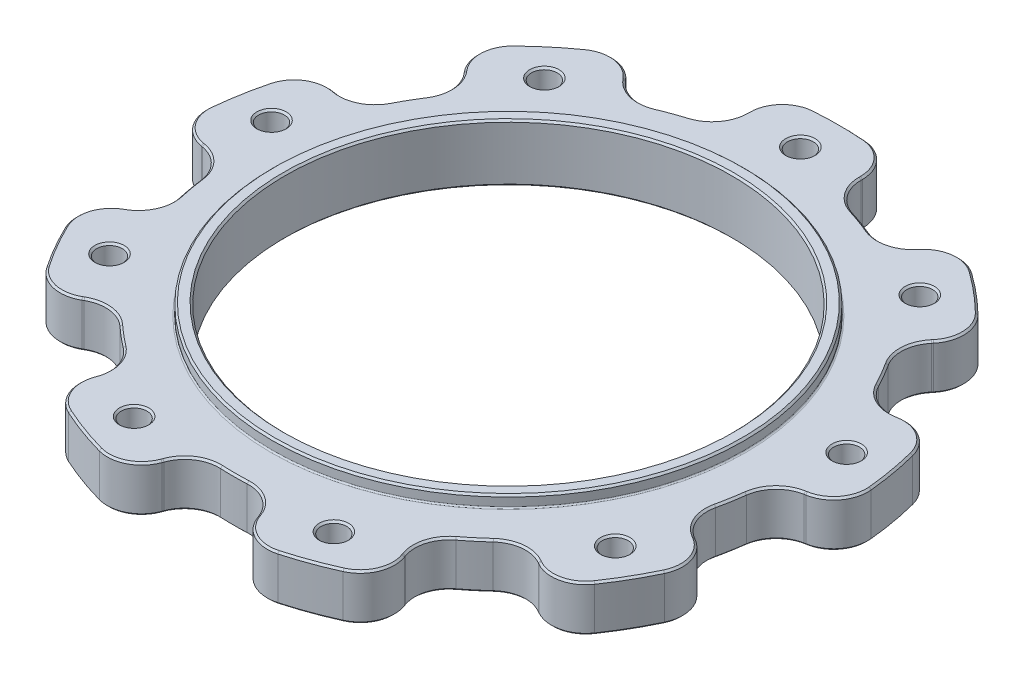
from build123d import *

# Parameters (mm, degrees)
SKETCH2_R               = 76.2
SKETCH2_R_2             = 65.405
SKETCH2_R_3             = 61.9125
BOSS_EXTRUDE2_DEPTH     = 6.35
BOSS_EXTRUDE4_START     = -6.35
SKETCH2_5_R             = 65.405
SKETCH2_5_R_2           = 61.9125
BOSS_EXTRUDE4_DEPTH     = 15.875
BOSS_EXTRUDE3_DEPTH     = 6.35
F_1_4_CLEARANCE_HOLE1_D = 7.1374
CIRPATTERN1_COUNT       = 9
FILLET1_R               = 9.525
FILLET2_R               = 0.381
CHAMFER1_SIZE           = 0.508


with BuildPart() as part:
    # Sketch2 → Boss-Extrude2 (new, symmetric)
    # profile 1 of 2: a face of its own
    with BuildSketch(Plane(origin=(0, 0, 0), x_dir=(1, 0, 0), z_dir=(0, 1, 0))):
        with Locations(Location((0, 0, 0), (0, 0, 270))):
            Circle(SKETCH2_R)
        Circle(SKETCH2_R_2, mode=Mode.SUBTRACT)
    # profile 2 of 2: a face of its own
    with BuildSketch(Plane(origin=(0, 0, 0), x_dir=(1, 0, 0), z_dir=(0, 1, 0))):
        Circle(SKETCH2_R_2)
        with Locations(Location((0, 0, 0), (0, 0, 270))):
            Circle(SKETCH2_R_3, mode=Mode.SUBTRACT)
    extrude(amount=BOSS_EXTRUDE2_DEPTH, both=True)

    # Sketch2_5 → Boss-Extrude4 (add)
    with BuildSketch(Plane(origin=(0, 0, 0), x_dir=(1, 0, 0), z_dir=(0, 1, 0)).offset(BOSS_EXTRUDE4_START)):
        with Locations(Location((0, 0, 0), (0, 0, 270))):
            Circle(SKETCH2_5_R)
        with Locations(Location((0, 0, 0), (0, 0, 270))):
            Circle(SKETCH2_5_R_2, mode=Mode.SUBTRACT)
    extrude(amount=BOSS_EXTRUDE4_DEPTH)

    # Sketch2_3 → Boss-Extrude3 (add, symmetric)
    with BuildSketch(Plane(origin=(0, 0, 0), x_dir=(1, 0, 0), z_dir=(0, 1, 0))):
        with BuildLine():
            Line((-15.875, 90.696141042), (-15.875, 74.528010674))
            ThreePointArc((-15.875, 74.528010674), (0, 76.2), (15.875, 74.528010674))
            Line((15.875, 74.528010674), (15.875, 90.696141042))
            ThreePointArc((15.875, 90.696141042), (0, 92.075), (-15.875, 90.696141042))
        make_face()
    boss_extrude3 = extrude(amount=BOSS_EXTRUDE3_DEPTH, both=True)

    # 1_4 Clearance Hole1 (through all)
    with Locations(Plane(origin=(0, 6.35, 0), x_dir=(1, 0, 0), z_dir=(0, 1, 0))):
        with Locations((0, 80.9625)):
            f_1_4_clearance_hole1 = Hole(F_1_4_CLEARANCE_HOLE1_D / 2)

    # CirPattern1: Boss-Extrude3, 1_4 Clearance Hole1 ×9 about axis
    cirpattern1_axis = Axis((0, 0, 0), (0, 1, 0))
    add([boss_extrude3.rotate(cirpattern1_axis, i * 360 / CIRPATTERN1_COUNT) for i in range(1, CIRPATTERN1_COUNT)])
    add([f_1_4_clearance_hole1.rotate(cirpattern1_axis, i * 360 / CIRPATTERN1_COUNT) for i in range(1, CIRPATTERN1_COUNT)], mode=Mode.SUBTRACT)

    # Fillet1
    fillet1_edges = [part.edges().sort_by_distance(p)[0] for p in [
        (60.06663737, 0, -46.88751513),
        (15.875, 0, -90.696141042),
        (-15.875, 0, -90.696141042),
        (-15.875, 0, -74.528010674),
        (15.875, 0, -74.528010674),
        (92.074927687, 0, -0.115396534),
        (86.561598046, 0, -31.383042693),
        (70.639097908, 0, -28.575476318),
        (76.152427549, 0, 2.69216984),
        (70.607662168, 0, 59.096223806),
        (86.482662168, 0, 31.599917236),
        (72.480650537, 0, 23.515852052),
        (56.605650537, 0, 51.012158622),
        (16.102286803, 0, 90.656064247),
        (45.937527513, 0, 79.796924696),
        (40.407701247, 0, 64.603851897),
        (10.572460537, 0, 75.462991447),
        (-45.937527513, 0, 79.796924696),
        (-16.102286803, 0, 90.656064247),
        (-10.572460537, 0, 75.462991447),
        (-40.407701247, 0, 64.603851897),
        (-86.482662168, 0, 31.599917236),
        (-70.607662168, 0, 59.096223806),
        (-56.605650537, 0, 51.012158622),
        (-72.480650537, 0, 23.515852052),
        (-86.561598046, 0, -31.383042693),
        (-92.074927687, 0, -0.115396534),
        (-76.152427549, 0, 2.69216984),
        (-70.639097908, 0, -28.575476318),
        (-46.137400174, 0, -79.681528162),
        (-70.459311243, 0, -59.273021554),
        (-60.06663737, 0, -46.88751513),
        (-35.744726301, 0, -67.296021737),
        (70.459311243, 0, -59.273021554),
        (46.137400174, 0, -79.681528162),
        (35.744726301, 0, -67.296021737),
    ]]
    fillet(fillet1_edges, radius=FILLET1_R)

    # Fillet2
    fillet2_edges = [part.edges().sort_by_distance(p)[0] for p in [
        (0, 6.35, -65.405),
    ]]
    fillet(fillet2_edges, radius=FILLET2_R)

    # Chamfer1
    chamfer1_edges = [part.edges().sort_by_distance(p)[0] for p in [
        (0, 9.525, -65.405),
        (0, 9.525, -61.9125),
        (54.775474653, 6.35, -59.726957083),
        (54.775474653, -6.35, -59.726957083),
        (80.352195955, 6.35, -10.544507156),
        (80.352195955, -6.35, -10.544507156),
        (68.331231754, 6.35, 43.571834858),
        (68.331231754, -6.35, 43.571834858),
        (24.337324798, 6.35, 77.300431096),
        (24.337324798, -6.35, 77.300431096),
        (-31.04428691, 6.35, 74.859296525),
        (-31.04428691, -6.35, 74.859296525),
        (-71.899931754, 6.35, 37.390665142),
        (-71.899931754, -6.35, 37.390665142),
        (-79.112799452, 6.35, -17.573474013),
        (-79.112799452, -6.35, -17.573474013),
        (-49.307909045, 6.35, -64.314789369),
        (-49.307909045, -6.35, -64.314789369),
        (79.029966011, -6.35, 27.297101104),
        (79.029966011, 6.35, 27.297101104),
        (-26.061934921, -6.35, -71.604577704),
        (-15.875, -6.35, -82.090508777),
        (0, -6.35, -92.075),
        (15.875, -6.35, -82.090508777),
        (26.061934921, -6.35, -71.604577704),
        (40.60580638, -6.35, -73.089231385),
        (59.184669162, -6.35, -70.5335421),
        (64.927717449, -6.35, -52.680724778),
        (65.991135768, -6.35, -38.1),
        (78.086704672, -6.35, -29.888690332),
        (90.676173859, -6.35, -15.988655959),
        (83.600034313, -6.35, 1.378955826),
        (75.04235078, -6.35, 13.231991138),
        (79.739289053, -6.35, 46.0375),
        (63.154966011, -6.35, 54.793407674),
        (48.980415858, -6.35, 58.372586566),
        (42.994227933, -6.35, 71.710275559),
        (31.491504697, -6.35, 86.522198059),
        (13.158987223, -6.35, 82.56941511),
        (0, -6.35, 76.2),
        (-13.158987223, -6.35, 82.56941511),
        (-31.491504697, -6.35, 86.522198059),
        (-42.994227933, -6.35, 71.710275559),
        (-48.980415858, -6.35, 58.372586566),
        (-63.154966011, -6.35, 54.793407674),
        (-79.739289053, -6.35, 46.0375),
        (-79.029966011, -6.35, 27.297101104),
        (-75.04235078, -6.35, 13.231991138),
        (-83.600034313, -6.35, 1.378955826),
        (-90.676173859, -6.35, -15.988655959),
        (-78.086704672, -6.35, -29.888690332),
        (-65.991135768, -6.35, -38.1),
        (-64.927717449, -6.35, -52.680724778),
        (-59.184669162, -6.35, -70.5335421),
        (-40.60580638, -6.35, -73.089231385),
        (89.744026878, -6.35, -2.279071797),
        (85.111288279, -6.35, -28.552637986),
        (67.28295398, -6.35, -59.432218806),
        (46.845747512, -6.35, -76.581071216),
        (13.339439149, -6.35, -88.77637012),
        (-13.339439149, -6.35, -88.77637012),
        (-46.845747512, -6.35, -76.581071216),
        (-67.28295398, -6.35, -59.432218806),
        (-85.111288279, -6.35, -28.552637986),
        (-89.744026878, -6.35, -2.279071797),
        (-83.552311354, -6.35, 32.835891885),
        (-70.212872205, -6.35, 55.940478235),
        (-42.898279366, -6.35, 78.860143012),
        (-17.828334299, -6.35, 87.984856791),
        (17.828334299, -6.35, 87.984856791),
        (42.898279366, -6.35, 78.860143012),
        (70.212872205, -6.35, 55.940478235),
        (83.552311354, -6.35, 32.835891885),
        (79.739289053, 6.35, 46.0375),
        (-26.061934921, 6.35, -71.604577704),
        (-40.60580638, 6.35, -73.089231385),
        (-59.184669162, 6.35, -70.5335421),
        (-64.927717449, 6.35, -52.680724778),
        (-65.991135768, 6.35, -38.1),
        (-78.086704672, 6.35, -29.888690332),
        (-90.676173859, 6.35, -15.988655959),
        (-83.600034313, 6.35, 1.378955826),
        (-75.04235078, 6.35, 13.231991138),
        (-79.029966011, 6.35, 27.297101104),
        (-79.739289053, 6.35, 46.0375),
        (-63.154966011, 6.35, 54.793407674),
        (-48.980415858, 6.35, 58.372586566),
        (-42.994227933, 6.35, 71.710275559),
        (-31.491504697, 6.35, 86.522198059),
        (-13.158987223, 6.35, 82.56941511),
        (0, 6.35, 76.2),
        (13.158987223, 6.35, 82.56941511),
        (31.491504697, 6.35, 86.522198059),
        (42.994227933, 6.35, 71.710275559),
        (48.980415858, 6.35, 58.372586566),
        (63.154966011, 6.35, 54.793407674),
        (75.04235078, 6.35, 13.231991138),
        (83.600034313, 6.35, 1.378955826),
        (90.676173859, 6.35, -15.988655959),
        (78.086704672, 6.35, -29.888690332),
        (65.991135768, 6.35, -38.1),
        (64.927717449, 6.35, -52.680724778),
        (59.184669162, 6.35, -70.5335421),
        (40.60580638, 6.35, -73.089231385),
        (26.061934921, 6.35, -71.604577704),
        (15.875, 6.35, -82.090508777),
        (0, 6.35, -92.075),
        (-15.875, 6.35, -82.090508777),
        (89.744026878, 6.35, -2.279071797),
        (85.111288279, 6.35, -28.552637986),
        (67.28295398, 6.35, -59.432218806),
        (46.845747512, 6.35, -76.581071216),
        (13.339439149, 6.35, -88.77637012),
        (-13.339439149, 6.35, -88.77637012),
        (-46.845747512, 6.35, -76.581071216),
        (-67.28295398, 6.35, -59.432218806),
        (-85.111288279, 6.35, -28.552637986),
        (-89.744026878, 6.35, -2.279071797),
        (-83.552311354, 6.35, 32.835891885),
        (-70.212872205, 6.35, 55.940478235),
        (-42.898279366, 6.35, 78.860143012),
        (-17.828334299, 6.35, 87.984856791),
        (17.828334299, 6.35, 87.984856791),
        (42.898279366, 6.35, 78.860143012),
        (70.212872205, 6.35, 55.940478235),
        (83.552311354, 6.35, 32.835891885),
        (57.147531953, -6.35, 53.468884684),
        (57.147531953, 6.35, 53.468884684),
        (0, -6.35, -61.9125),
        (42.7330074, -6.35, 65.56410692),
        (3.5687, 6.35, -80.9625),
        (42.7330074, 6.35, 65.56410692),
        (3.5687, -6.35, -80.9625),
        (9.408412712, -6.35, 77.693267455),
        (9.408412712, 6.35, 77.693267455),
        (-9.408412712, -6.35, 77.693267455),
        (-9.408412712, 6.35, 77.693267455),
        (-42.7330074, -6.35, 65.56410692),
        (-42.7330074, 6.35, 65.56410692),
        (-57.147531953, -6.35, 53.468884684),
        (-57.147531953, 6.35, 53.468884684),
        (-74.879178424, -6.35, 22.756772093),
        (-74.879178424, 6.35, 22.756772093),
        (-78.146685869, -6.35, 4.225816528),
        (-78.146685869, 6.35, 4.225816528),
        (-71.988549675, -6.35, -30.69870931),
        (-71.988549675, 6.35, -30.69870931),
        (-62.580136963, -6.35, -46.994558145),
        (-62.580136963, 6.35, -46.994558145),
        (-35.413678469, -6.35, -69.789923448),
        (-35.413678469, 6.35, -69.789923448),
        (74.879178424, -6.35, 22.756772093),
        (74.879178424, 6.35, 22.756772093),
        (-17.731646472, -6.35, -76.225656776),
        (-17.731646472, 6.35, -76.225656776),
        (17.731646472, -6.35, -76.225656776),
        (17.731646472, 6.35, -76.225656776),
        (35.413678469, -6.35, -69.789923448),
        (35.413678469, 6.35, -69.789923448),
        (62.580136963, -6.35, -46.994558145),
        (62.580136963, 6.35, -46.994558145),
        (71.988549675, -6.35, -30.69870931),
        (71.988549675, 6.35, -30.69870931),
        (78.146685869, -6.35, 4.225816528),
        (78.146685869, 6.35, 4.225816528),
    ]]
    chamfer(chamfer1_edges, length=CHAMFER1_SIZE)


solid = part.part
